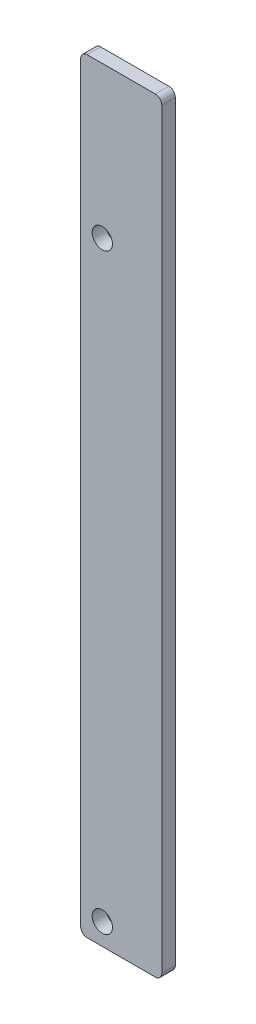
ISO-10303-21;
HEADER;
FILE_DESCRIPTION(('STEP AP214'),'2;1');
FILE_NAME('part.step','',(''),(''),'','','');
FILE_SCHEMA(('AUTOMOTIVE_DESIGN { 1 0 10303 214 1 1 1 1 }'));
ENDSEC;
DATA;
#1=APPLICATION_CONTEXT('core data for automotive mechanical design processes');
#2=APPLICATION_PROTOCOL_DEFINITION('international standard','automotive_design',2000,#1);
#3=PRODUCT_CONTEXT('',#1,'mechanical');
#4=PRODUCT('Part','Part','',(#3));
#5=PRODUCT_RELATED_PRODUCT_CATEGORY('part','',(#4));
#6=PRODUCT_DEFINITION_FORMATION('','',#4);
#7=PRODUCT_DEFINITION_CONTEXT('part definition',#1,'design');
#8=PRODUCT_DEFINITION('design','',#6,#7);
#9=PRODUCT_DEFINITION_SHAPE('','',#8);
#10=(LENGTH_UNIT() NAMED_UNIT(*) SI_UNIT(.MILLI.,.METRE.));
#11=(NAMED_UNIT(*) PLANE_ANGLE_UNIT() SI_UNIT($,.RADIAN.));
#12=(NAMED_UNIT(*) SI_UNIT($,.STERADIAN.) SOLID_ANGLE_UNIT());
#13=UNCERTAINTY_MEASURE_WITH_UNIT(LENGTH_MEASURE(1.E-05),#10,'distance_accuracy_value','');
#14=(GEOMETRIC_REPRESENTATION_CONTEXT(3) GLOBAL_UNCERTAINTY_ASSIGNED_CONTEXT((#13)) GLOBAL_UNIT_ASSIGNED_CONTEXT((#10,
#11,#12)) REPRESENTATION_CONTEXT('',''));
#15=CARTESIAN_POINT('',(0.,0.,0.));
#16=DIRECTION('',(0.,0.,1.));
#17=DIRECTION('',(1.,0.,0.));
#18=AXIS2_PLACEMENT_3D('',#15,#16,#17);
#19=CARTESIAN_POINT('',(-1216.2082135,-21.844,3.175));
#20=DIRECTION('',(0.,0.,-1.));
#21=DIRECTION('',(-1.,0.,0.));
#22=AXIS2_PLACEMENT_3D('',#19,#20,#21);
#23=CYLINDRICAL_SURFACE('',#22,1.52400000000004);
#24=CARTESIAN_POINT('',(-1216.2082135,-21.844,0.));
#25=DIRECTION('',(0.,0.,1.));
#26=DIRECTION('',(1.,0.,0.));
#27=AXIS2_PLACEMENT_3D('',#24,#25,#26);
#28=CIRCLE('',#27,1.52400000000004);
#29=CARTESIAN_POINT('',(-1216.2082135,-20.32,0.));
#30=VERTEX_POINT('',#29);
#31=CARTESIAN_POINT('',(-1217.7322135,-21.844,0.));
#32=VERTEX_POINT('',#31);
#33=EDGE_CURVE('E149',#30,#32,#28,.T.);
#34=ORIENTED_EDGE('',*,*,#33,.T.);
#35=DIRECTION('',(0.,0.,-1.));
#36=VECTOR('',#35,1.);
#37=CARTESIAN_POINT('',(-1217.7322135,-21.844,3.175));
#38=LINE('',#37,#36);
#39=CARTESIAN_POINT('',(-1217.7322135,-21.844,3.175));
#40=VERTEX_POINT('',#39);
#41=EDGE_CURVE('E11',#40,#32,#38,.T.);
#42=ORIENTED_EDGE('',*,*,#41,.F.);
#43=CARTESIAN_POINT('',(-1216.2082135,-21.844,3.175));
#44=DIRECTION('',(0.,0.,1.));
#45=DIRECTION('',(1.,0.,0.));
#46=AXIS2_PLACEMENT_3D('',#43,#44,#45);
#47=CIRCLE('',#46,1.52400000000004);
#48=CARTESIAN_POINT('',(-1216.2082135,-20.32,3.175));
#49=VERTEX_POINT('',#48);
#50=EDGE_CURVE('E172',#49,#40,#47,.T.);
#51=ORIENTED_EDGE('',*,*,#50,.F.);
#52=DIRECTION('',(0.,0.,-1.));
#53=VECTOR('',#52,1.);
#54=CARTESIAN_POINT('',(-1216.2082135,-20.32,3.175));
#55=LINE('',#54,#53);
#56=EDGE_CURVE('E145',#49,#30,#55,.T.);
#57=ORIENTED_EDGE('',*,*,#56,.T.);
#58=EDGE_LOOP('',(#34,#42,#51,#57));
#59=FACE_BOUND('',#58,.T.);
#60=ADVANCED_FACE('F47',(#59),#23,.T.);
#61=CARTESIAN_POINT('',(-1217.7322135,-21.844,3.175));
#62=DIRECTION('',(1.,0.,0.));
#63=DIRECTION('',(0.,0.,-1.));
#64=AXIS2_PLACEMENT_3D('',#61,#62,#63);
#65=PLANE('',#64);
#66=DIRECTION('',(0.,-1.,0.));
#67=VECTOR('',#66,1.);
#68=CARTESIAN_POINT('',(-1217.7322135,-21.844,0.));
#69=LINE('',#68,#67);
#70=CARTESIAN_POINT('',(-1217.7322135,-198.501,0.));
#71=VERTEX_POINT('',#70);
#72=EDGE_CURVE('E153',#32,#71,#69,.T.);
#73=ORIENTED_EDGE('',*,*,#72,.T.);
#74=DIRECTION('',(0.,0.,-1.));
#75=VECTOR('',#74,1.);
#76=CARTESIAN_POINT('',(-1217.7322135,-198.501,3.175));
#77=LINE('',#76,#75);
#78=CARTESIAN_POINT('',(-1217.7322135,-198.501,3.175));
#79=VERTEX_POINT('',#78);
#80=EDGE_CURVE('E56',#79,#71,#77,.T.);
#81=ORIENTED_EDGE('',*,*,#80,.F.);
#82=DIRECTION('',(0.,-1.,0.));
#83=VECTOR('',#82,1.);
#84=CARTESIAN_POINT('',(-1217.7322135,-21.844,3.175));
#85=LINE('',#84,#83);
#86=EDGE_CURVE('E107',#40,#79,#85,.T.);
#87=ORIENTED_EDGE('',*,*,#86,.F.);
#88=ORIENTED_EDGE('',*,*,#41,.T.);
#89=EDGE_LOOP('',(#73,#81,#87,#88));
#90=FACE_BOUND('',#89,.T.);
#91=ADVANCED_FACE('F259',(#90),#65,.F.);
#92=CARTESIAN_POINT('',(-1216.2082135,-198.501,3.175));
#93=DIRECTION('',(0.,0.,-1.));
#94=DIRECTION('',(-1.,0.,0.));
#95=AXIS2_PLACEMENT_3D('',#92,#93,#94);
#96=CYLINDRICAL_SURFACE('',#95,1.52400000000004);
#97=CARTESIAN_POINT('',(-1216.2082135,-198.501,0.));
#98=DIRECTION('',(0.,0.,1.));
#99=DIRECTION('',(-1.,0.,0.));
#100=AXIS2_PLACEMENT_3D('',#97,#98,#99);
#101=CIRCLE('',#100,1.52400000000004);
#102=CARTESIAN_POINT('',(-1216.2082135,-200.025,0.));
#103=VERTEX_POINT('',#102);
#104=EDGE_CURVE('E157',#71,#103,#101,.T.);
#105=ORIENTED_EDGE('',*,*,#104,.T.);
#106=DIRECTION('',(0.,0.,-1.));
#107=VECTOR('',#106,1.);
#108=CARTESIAN_POINT('',(-1216.2082135,-200.025,3.175));
#109=LINE('',#108,#107);
#110=CARTESIAN_POINT('',(-1216.2082135,-200.025,3.175));
#111=VERTEX_POINT('',#110);
#112=EDGE_CURVE('E183',#111,#103,#109,.T.);
#113=ORIENTED_EDGE('',*,*,#112,.F.);
#114=CARTESIAN_POINT('',(-1216.2082135,-198.501,3.175));
#115=DIRECTION('',(0.,0.,1.));
#116=DIRECTION('',(-1.,0.,0.));
#117=AXIS2_PLACEMENT_3D('',#114,#115,#116);
#118=CIRCLE('',#117,1.52400000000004);
#119=EDGE_CURVE('E194',#79,#111,#118,.T.);
#120=ORIENTED_EDGE('',*,*,#119,.F.);
#121=ORIENTED_EDGE('',*,*,#80,.T.);
#122=EDGE_LOOP('',(#105,#113,#120,#121));
#123=FACE_BOUND('',#122,.T.);
#124=ADVANCED_FACE('F192',(#123),#96,.T.);
#125=CARTESIAN_POINT('',(-1200.2062135,-200.025,3.175));
#126=DIRECTION('',(0.,1.,0.));
#127=DIRECTION('',(0.,0.,1.));
#128=AXIS2_PLACEMENT_3D('',#125,#126,#127);
#129=PLANE('',#128);
#130=DIRECTION('',(1.,0.,0.));
#131=VECTOR('',#130,1.);
#132=CARTESIAN_POINT('',(-1200.2062135,-200.025,0.));
#133=LINE('',#132,#131);
#134=CARTESIAN_POINT('',(-1200.2062135,-200.025,0.));
#135=VERTEX_POINT('',#134);
#136=EDGE_CURVE('E160',#103,#135,#133,.T.);
#137=ORIENTED_EDGE('',*,*,#136,.T.);
#138=DIRECTION('',(0.,0.,-1.));
#139=VECTOR('',#138,1.);
#140=CARTESIAN_POINT('',(-1200.2062135,-200.025,3.175));
#141=LINE('',#140,#139);
#142=CARTESIAN_POINT('',(-1200.2062135,-200.025,3.175));
#143=VERTEX_POINT('',#142);
#144=EDGE_CURVE('E179',#143,#135,#141,.T.);
#145=ORIENTED_EDGE('',*,*,#144,.F.);
#146=DIRECTION('',(1.,0.,0.));
#147=VECTOR('',#146,1.);
#148=CARTESIAN_POINT('',(-1200.2062135,-200.025,3.175));
#149=LINE('',#148,#147);
#150=EDGE_CURVE('E207',#111,#143,#149,.T.);
#151=ORIENTED_EDGE('',*,*,#150,.F.);
#152=ORIENTED_EDGE('',*,*,#112,.T.);
#153=EDGE_LOOP('',(#137,#145,#151,#152));
#154=FACE_BOUND('',#153,.T.);
#155=ADVANCED_FACE('F202',(#154),#129,.F.);
#156=CARTESIAN_POINT('',(-1200.2062135,-198.501,3.175));
#157=DIRECTION('',(0.,0.,-1.));
#158=DIRECTION('',(-1.,0.,0.));
#159=AXIS2_PLACEMENT_3D('',#156,#157,#158);
#160=CYLINDRICAL_SURFACE('',#159,1.52400000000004);
#161=CARTESIAN_POINT('',(-1200.2062135,-198.501,0.));
#162=DIRECTION('',(0.,0.,1.));
#163=DIRECTION('',(-1.,0.,0.));
#164=AXIS2_PLACEMENT_3D('',#161,#162,#163);
#165=CIRCLE('',#164,1.52400000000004);
#166=CARTESIAN_POINT('',(-1198.6822135,-198.501,0.));
#167=VERTEX_POINT('',#166);
#168=EDGE_CURVE('E163',#135,#167,#165,.T.);
#169=ORIENTED_EDGE('',*,*,#168,.T.);
#170=DIRECTION('',(0.,0.,-1.));
#171=VECTOR('',#170,1.);
#172=CARTESIAN_POINT('',(-1198.6822135,-198.501,3.175));
#173=LINE('',#172,#171);
#174=CARTESIAN_POINT('',(-1198.6822135,-198.501,3.175));
#175=VERTEX_POINT('',#174);
#176=EDGE_CURVE('E137',#175,#167,#173,.T.);
#177=ORIENTED_EDGE('',*,*,#176,.F.);
#178=CARTESIAN_POINT('',(-1200.2062135,-198.501,3.175));
#179=DIRECTION('',(0.,0.,1.));
#180=DIRECTION('',(-1.,0.,0.));
#181=AXIS2_PLACEMENT_3D('',#178,#179,#180);
#182=CIRCLE('',#181,1.52400000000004);
#183=EDGE_CURVE('E126',#143,#175,#182,.T.);
#184=ORIENTED_EDGE('',*,*,#183,.F.);
#185=ORIENTED_EDGE('',*,*,#144,.T.);
#186=EDGE_LOOP('',(#169,#177,#184,#185));
#187=FACE_BOUND('',#186,.T.);
#188=ADVANCED_FACE('F205',(#187),#160,.T.);
#189=CARTESIAN_POINT('',(-1198.6822135,-21.844,3.175));
#190=DIRECTION('',(-1.,0.,0.));
#191=DIRECTION('',(0.,0.,1.));
#192=AXIS2_PLACEMENT_3D('',#189,#190,#191);
#193=PLANE('',#192);
#194=DIRECTION('',(0.,1.,0.));
#195=VECTOR('',#194,1.);
#196=CARTESIAN_POINT('',(-1198.6822135,-21.844,0.));
#197=LINE('',#196,#195);
#198=CARTESIAN_POINT('',(-1198.6822135,-21.844,0.));
#199=VERTEX_POINT('',#198);
#200=EDGE_CURVE('E135',#167,#199,#197,.T.);
#201=ORIENTED_EDGE('',*,*,#200,.T.);
#202=DIRECTION('',(0.,0.,-1.));
#203=VECTOR('',#202,1.);
#204=CARTESIAN_POINT('',(-1198.6822135,-21.844,3.175));
#205=LINE('',#204,#203);
#206=CARTESIAN_POINT('',(-1198.6822135,-21.844,3.175));
#207=VERTEX_POINT('',#206);
#208=EDGE_CURVE('E132',#207,#199,#205,.T.);
#209=ORIENTED_EDGE('',*,*,#208,.F.);
#210=DIRECTION('',(0.,1.,0.));
#211=VECTOR('',#210,1.);
#212=CARTESIAN_POINT('',(-1198.6822135,-21.844,3.175));
#213=LINE('',#212,#211);
#214=EDGE_CURVE('E120',#175,#207,#213,.T.);
#215=ORIENTED_EDGE('',*,*,#214,.F.);
#216=ORIENTED_EDGE('',*,*,#176,.T.);
#217=EDGE_LOOP('',(#201,#209,#215,#216));
#218=FACE_BOUND('',#217,.T.);
#219=ADVANCED_FACE('F133',(#218),#193,.F.);
#220=CARTESIAN_POINT('',(-1200.2062135,-21.844,3.175));
#221=DIRECTION('',(0.,0.,-1.));
#222=DIRECTION('',(-1.,0.,0.));
#223=AXIS2_PLACEMENT_3D('',#220,#221,#222);
#224=CYLINDRICAL_SURFACE('',#223,1.52400000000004);
#225=CARTESIAN_POINT('',(-1200.2062135,-21.844,0.));
#226=DIRECTION('',(0.,0.,1.));
#227=DIRECTION('',(-1.,0.,0.));
#228=AXIS2_PLACEMENT_3D('',#225,#226,#227);
#229=CIRCLE('',#228,1.52400000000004);
#230=CARTESIAN_POINT('',(-1200.2062135,-20.32,0.));
#231=VERTEX_POINT('',#230);
#232=EDGE_CURVE('E93',#199,#231,#229,.T.);
#233=ORIENTED_EDGE('',*,*,#232,.T.);
#234=DIRECTION('',(0.,0.,-1.));
#235=VECTOR('',#234,1.);
#236=CARTESIAN_POINT('',(-1200.2062135,-20.32,3.175));
#237=LINE('',#236,#235);
#238=CARTESIAN_POINT('',(-1200.2062135,-20.32,3.175));
#239=VERTEX_POINT('',#238);
#240=EDGE_CURVE('E138',#239,#231,#237,.T.);
#241=ORIENTED_EDGE('',*,*,#240,.F.);
#242=CARTESIAN_POINT('',(-1200.2062135,-21.844,3.175));
#243=DIRECTION('',(0.,0.,1.));
#244=DIRECTION('',(-1.,0.,0.));
#245=AXIS2_PLACEMENT_3D('',#242,#243,#244);
#246=CIRCLE('',#245,1.52400000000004);
#247=EDGE_CURVE('E124',#207,#239,#246,.T.);
#248=ORIENTED_EDGE('',*,*,#247,.F.);
#249=ORIENTED_EDGE('',*,*,#208,.T.);
#250=EDGE_LOOP('',(#233,#241,#248,#249));
#251=FACE_BOUND('',#250,.T.);
#252=ADVANCED_FACE('F140',(#251),#224,.T.);
#253=CARTESIAN_POINT('',(-1200.2062135,-20.32,3.175));
#254=DIRECTION('',(0.,-1.,0.));
#255=DIRECTION('',(0.,0.,-1.));
#256=AXIS2_PLACEMENT_3D('',#253,#254,#255);
#257=PLANE('',#256);
#258=DIRECTION('',(-1.,0.,0.));
#259=VECTOR('',#258,1.);
#260=CARTESIAN_POINT('',(-1200.2062135,-20.32,0.));
#261=LINE('',#260,#259);
#262=EDGE_CURVE('E99',#231,#30,#261,.T.);
#263=ORIENTED_EDGE('',*,*,#262,.T.);
#264=ORIENTED_EDGE('',*,*,#56,.F.);
#265=DIRECTION('',(-1.,0.,0.));
#266=VECTOR('',#265,1.);
#267=CARTESIAN_POINT('',(-1200.2062135,-20.32,3.175));
#268=LINE('',#267,#266);
#269=EDGE_CURVE('E64',#239,#49,#268,.T.);
#270=ORIENTED_EDGE('',*,*,#269,.F.);
#271=ORIENTED_EDGE('',*,*,#240,.T.);
#272=EDGE_LOOP('',(#263,#264,#270,#271));
#273=FACE_BOUND('',#272,.T.);
#274=ADVANCED_FACE('F246',(#273),#257,.F.);
#275=CARTESIAN_POINT('',(-1216.2082135,-21.844,3.175));
#276=DIRECTION('',(0.,0.,1.));
#277=DIRECTION('',(1.,0.,0.));
#278=AXIS2_PLACEMENT_3D('',#275,#276,#277);
#279=PLANE('',#278);
#280=CARTESIAN_POINT('',(-1212.6522135,-55.88,3.175));
#281=DIRECTION('',(0.,0.,1.));
#282=DIRECTION('',(1.,0.,0.));
#283=AXIS2_PLACEMENT_3D('',#280,#281,#282);
#284=CIRCLE('',#283,2.38125);
#285=CARTESIAN_POINT('',(-1210.2709635,-55.88,3.175));
#286=VERTEX_POINT('',#285);
#287=EDGE_CURVE('E225',#286,#286,#284,.T.);
#288=ORIENTED_EDGE('',*,*,#287,.F.);
#289=EDGE_LOOP('',(#288));
#290=FACE_BOUND('',#289,.T.);
#291=CARTESIAN_POINT('',(-1212.6522135,-194.945,3.175));
#292=DIRECTION('',(0.,0.,1.));
#293=DIRECTION('',(1.,0.,0.));
#294=AXIS2_PLACEMENT_3D('',#291,#292,#293);
#295=CIRCLE('',#294,2.38125);
#296=CARTESIAN_POINT('',(-1210.2709635,-194.945,3.175));
#297=VERTEX_POINT('',#296);
#298=EDGE_CURVE('E154',#297,#297,#295,.T.);
#299=ORIENTED_EDGE('',*,*,#298,.F.);
#300=EDGE_LOOP('',(#299));
#301=FACE_BOUND('',#300,.T.);
#302=ORIENTED_EDGE('',*,*,#50,.T.);
#303=ORIENTED_EDGE('',*,*,#86,.T.);
#304=ORIENTED_EDGE('',*,*,#119,.T.);
#305=ORIENTED_EDGE('',*,*,#150,.T.);
#306=ORIENTED_EDGE('',*,*,#183,.T.);
#307=ORIENTED_EDGE('',*,*,#214,.T.);
#308=ORIENTED_EDGE('',*,*,#247,.T.);
#309=ORIENTED_EDGE('',*,*,#269,.T.);
#310=EDGE_LOOP('',(#302,#303,#304,#305,#306,#307,#308,#309));
#311=FACE_BOUND('',#310,.T.);
#312=ADVANCED_FACE('F122',(#290,#301,#311),#279,.T.);
#313=CARTESIAN_POINT('',(-1216.2082135,-21.844,0.));
#314=DIRECTION('',(0.,0.,1.));
#315=DIRECTION('',(1.,0.,0.));
#316=AXIS2_PLACEMENT_3D('',#313,#314,#315);
#317=PLANE('',#316);
#318=CARTESIAN_POINT('',(-1212.6522135,-55.88,0.));
#319=DIRECTION('',(0.,0.,1.));
#320=DIRECTION('',(1.,0.,0.));
#321=AXIS2_PLACEMENT_3D('',#318,#319,#320);
#322=CIRCLE('',#321,2.38125);
#323=CARTESIAN_POINT('',(-1210.2709635,-55.88,0.));
#324=VERTEX_POINT('',#323);
#325=EDGE_CURVE('E229',#324,#324,#322,.T.);
#326=ORIENTED_EDGE('',*,*,#325,.T.);
#327=EDGE_LOOP('',(#326));
#328=FACE_BOUND('',#327,.T.);
#329=CARTESIAN_POINT('',(-1212.6522135,-194.945,0.));
#330=DIRECTION('',(0.,0.,1.));
#331=DIRECTION('',(1.,0.,0.));
#332=AXIS2_PLACEMENT_3D('',#329,#330,#331);
#333=CIRCLE('',#332,2.38125);
#334=CARTESIAN_POINT('',(-1210.2709635,-194.945,0.));
#335=VERTEX_POINT('',#334);
#336=EDGE_CURVE('E221',#335,#335,#333,.T.);
#337=ORIENTED_EDGE('',*,*,#336,.T.);
#338=EDGE_LOOP('',(#337));
#339=FACE_BOUND('',#338,.T.);
#340=ORIENTED_EDGE('',*,*,#33,.F.);
#341=ORIENTED_EDGE('',*,*,#262,.F.);
#342=ORIENTED_EDGE('',*,*,#232,.F.);
#343=ORIENTED_EDGE('',*,*,#200,.F.);
#344=ORIENTED_EDGE('',*,*,#168,.F.);
#345=ORIENTED_EDGE('',*,*,#136,.F.);
#346=ORIENTED_EDGE('',*,*,#104,.F.);
#347=ORIENTED_EDGE('',*,*,#72,.F.);
#348=EDGE_LOOP('',(#340,#341,#342,#343,#344,#345,#346,#347));
#349=FACE_BOUND('',#348,.T.);
#350=ADVANCED_FACE('F198',(#328,#339,#349),#317,.F.);
#351=CARTESIAN_POINT('',(-1212.6522135,-194.945,3.175));
#352=DIRECTION('',(0.,0.,1.));
#353=DIRECTION('',(1.,0.,0.));
#354=AXIS2_PLACEMENT_3D('',#351,#352,#353);
#355=CYLINDRICAL_SURFACE('',#354,2.38125);
#356=ORIENTED_EDGE('',*,*,#336,.F.);
#357=EDGE_LOOP('',(#356));
#358=FACE_BOUND('',#357,.T.);
#359=ORIENTED_EDGE('',*,*,#298,.T.);
#360=EDGE_LOOP('',(#359));
#361=FACE_BOUND('',#360,.T.);
#362=ADVANCED_FACE('F240',(#358,#361),#355,.F.);
#363=CARTESIAN_POINT('',(-1212.6522135,-55.88,3.175));
#364=DIRECTION('',(0.,0.,1.));
#365=DIRECTION('',(1.,0.,0.));
#366=AXIS2_PLACEMENT_3D('',#363,#364,#365);
#367=CYLINDRICAL_SURFACE('',#366,2.38125);
#368=ORIENTED_EDGE('',*,*,#325,.F.);
#369=EDGE_LOOP('',(#368));
#370=FACE_BOUND('',#369,.T.);
#371=ORIENTED_EDGE('',*,*,#287,.T.);
#372=EDGE_LOOP('',(#371));
#373=FACE_BOUND('',#372,.T.);
#374=ADVANCED_FACE('F237',(#370,#373),#367,.F.);
#375=CLOSED_SHELL('',(#60,#91,#124,#155,#188,#219,#252,#274,#312,#350,#362,#374));
#376=MANIFOLD_SOLID_BREP('B2',#375);
#377=ADVANCED_BREP_SHAPE_REPRESENTATION('',(#18,#376),#14);
#378=SHAPE_DEFINITION_REPRESENTATION(#9,#377);
ENDSEC;
END-ISO-10303-21;
